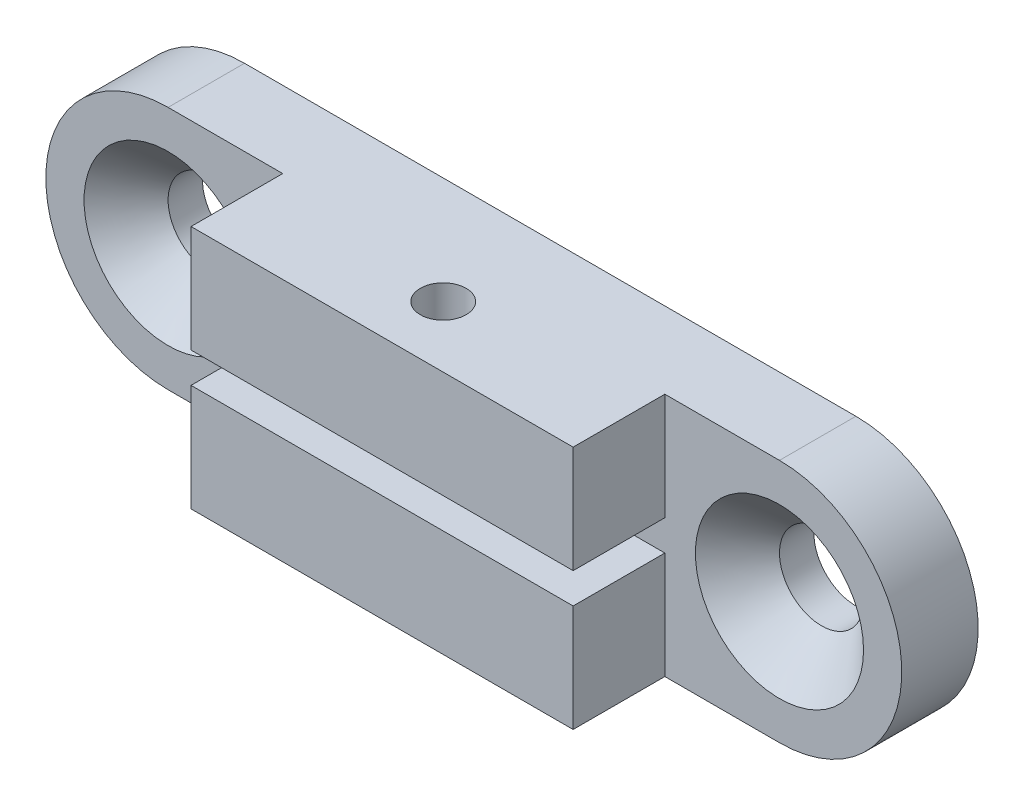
ISO-10303-21;
HEADER;
FILE_DESCRIPTION(('STEP AP214'),'2;1');
FILE_NAME('part.step','',(''),(''),'','','');
FILE_SCHEMA(('AUTOMOTIVE_DESIGN { 1 0 10303 214 1 1 1 1 }'));
ENDSEC;
DATA;
#1=APPLICATION_CONTEXT('core data for automotive mechanical design processes');
#2=APPLICATION_PROTOCOL_DEFINITION('international standard','automotive_design',2000,#1);
#3=PRODUCT_CONTEXT('',#1,'mechanical');
#4=PRODUCT('Part','Part','',(#3));
#5=PRODUCT_RELATED_PRODUCT_CATEGORY('part','',(#4));
#6=PRODUCT_DEFINITION_FORMATION('','',#4);
#7=PRODUCT_DEFINITION_CONTEXT('part definition',#1,'design');
#8=PRODUCT_DEFINITION('design','',#6,#7);
#9=PRODUCT_DEFINITION_SHAPE('','',#8);
#10=(LENGTH_UNIT() NAMED_UNIT(*) SI_UNIT(.MILLI.,.METRE.));
#11=(NAMED_UNIT(*) PLANE_ANGLE_UNIT() SI_UNIT($,.RADIAN.));
#12=(NAMED_UNIT(*) SI_UNIT($,.STERADIAN.) SOLID_ANGLE_UNIT());
#13=UNCERTAINTY_MEASURE_WITH_UNIT(LENGTH_MEASURE(1.E-05),#10,'distance_accuracy_value','');
#14=(GEOMETRIC_REPRESENTATION_CONTEXT(3) GLOBAL_UNCERTAINTY_ASSIGNED_CONTEXT((#13)) GLOBAL_UNIT_ASSIGNED_CONTEXT((#10,
#11,#12)) REPRESENTATION_CONTEXT('',''));
#15=CARTESIAN_POINT('',(0.,0.,0.));
#16=DIRECTION('',(0.,0.,1.));
#17=DIRECTION('',(1.,0.,0.));
#18=AXIS2_PLACEMENT_3D('',#15,#16,#17);
#19=CARTESIAN_POINT('',(12.5,1.,5.));
#20=DIRECTION('',(0.,-1.,0.));
#21=DIRECTION('',(0.,0.,-1.));
#22=AXIS2_PLACEMENT_3D('',#19,#20,#21);
#23=PLANE('',#22);
#24=CARTESIAN_POINT('',(0.,1.,7.));
#25=DIRECTION('',(0.,1.,0.));
#26=DIRECTION('',(0.,0.,1.));
#27=AXIS2_PLACEMENT_3D('',#24,#25,#26);
#28=CIRCLE('',#27,1.5);
#29=CARTESIAN_POINT('',(0.,1.,8.5));
#30=VERTEX_POINT('',#29);
#31=EDGE_CURVE('E162',#30,#30,#28,.T.);
#32=ORIENTED_EDGE('',*,*,#31,.T.);
#33=EDGE_LOOP('',(#32));
#34=FACE_BOUND('',#33,.T.);
#35=DIRECTION('',(1.,0.,0.));
#36=VECTOR('',#35,1.);
#37=CARTESIAN_POINT('',(0.,1.,5.));
#38=LINE('',#37,#36);
#39=CARTESIAN_POINT('',(12.5,1.,5.));
#40=VERTEX_POINT('',#39);
#41=CARTESIAN_POINT('',(-12.5,1.,5.));
#42=VERTEX_POINT('',#41);
#43=EDGE_CURVE('E169',#40,#42,#38,.F.);
#44=ORIENTED_EDGE('',*,*,#43,.F.);
#45=DIRECTION('',(0.,0.,-1.));
#46=VECTOR('',#45,1.);
#47=CARTESIAN_POINT('',(12.5,1.,5.));
#48=LINE('',#47,#46);
#49=CARTESIAN_POINT('',(12.5,1.,11.));
#50=VERTEX_POINT('',#49);
#51=EDGE_CURVE('E165',#50,#40,#48,.T.);
#52=ORIENTED_EDGE('',*,*,#51,.F.);
#53=DIRECTION('',(1.,0.,0.));
#54=VECTOR('',#53,1.);
#55=CARTESIAN_POINT('',(0.,1.,11.));
#56=LINE('',#55,#54);
#57=CARTESIAN_POINT('',(-12.5,1.,11.));
#58=VERTEX_POINT('',#57);
#59=EDGE_CURVE('E130',#58,#50,#56,.T.);
#60=ORIENTED_EDGE('',*,*,#59,.F.);
#61=DIRECTION('',(0.,0.,1.));
#62=VECTOR('',#61,1.);
#63=CARTESIAN_POINT('',(-12.5,1.,5.));
#64=LINE('',#63,#62);
#65=EDGE_CURVE('E179',#42,#58,#64,.T.);
#66=ORIENTED_EDGE('',*,*,#65,.F.);
#67=EDGE_LOOP('',(#44,#52,#60,#66));
#68=FACE_BOUND('',#67,.T.);
#69=ADVANCED_FACE('F15',(#34,#68),#23,.T.);
#70=CARTESIAN_POINT('',(-12.5,-1.,5.));
#71=DIRECTION('',(0.,1.,0.));
#72=DIRECTION('',(0.,0.,1.));
#73=AXIS2_PLACEMENT_3D('',#70,#71,#72);
#74=PLANE('',#73);
#75=CARTESIAN_POINT('',(0.,-1.,7.));
#76=DIRECTION('',(0.,1.,0.));
#77=DIRECTION('',(0.,0.,1.));
#78=AXIS2_PLACEMENT_3D('',#75,#76,#77);
#79=CIRCLE('',#78,1.5);
#80=CARTESIAN_POINT('',(0.,-1.,8.5));
#81=VERTEX_POINT('',#80);
#82=EDGE_CURVE('E18',#81,#81,#79,.F.);
#83=ORIENTED_EDGE('',*,*,#82,.T.);
#84=EDGE_LOOP('',(#83));
#85=FACE_BOUND('',#84,.T.);
#86=DIRECTION('',(1.,0.,0.));
#87=VECTOR('',#86,1.);
#88=CARTESIAN_POINT('',(0.,-1.,5.));
#89=LINE('',#88,#87);
#90=CARTESIAN_POINT('',(-12.5,-1.,5.));
#91=VERTEX_POINT('',#90);
#92=CARTESIAN_POINT('',(12.5,-1.,5.));
#93=VERTEX_POINT('',#92);
#94=EDGE_CURVE('E183',#91,#93,#89,.T.);
#95=ORIENTED_EDGE('',*,*,#94,.F.);
#96=DIRECTION('',(0.,0.,1.));
#97=VECTOR('',#96,1.);
#98=CARTESIAN_POINT('',(-12.5,-1.,5.));
#99=LINE('',#98,#97);
#100=CARTESIAN_POINT('',(-12.5,-1.,11.));
#101=VERTEX_POINT('',#100);
#102=EDGE_CURVE('E125',#101,#91,#99,.F.);
#103=ORIENTED_EDGE('',*,*,#102,.F.);
#104=DIRECTION('',(1.,0.,0.));
#105=VECTOR('',#104,1.);
#106=CARTESIAN_POINT('',(0.,-1.,11.));
#107=LINE('',#106,#105);
#108=CARTESIAN_POINT('',(12.5,-1.,11.));
#109=VERTEX_POINT('',#108);
#110=EDGE_CURVE('E119',#109,#101,#107,.F.);
#111=ORIENTED_EDGE('',*,*,#110,.F.);
#112=DIRECTION('',(0.,0.,-1.));
#113=VECTOR('',#112,1.);
#114=CARTESIAN_POINT('',(12.5,-1.,5.));
#115=LINE('',#114,#113);
#116=EDGE_CURVE('E104',#93,#109,#115,.F.);
#117=ORIENTED_EDGE('',*,*,#116,.F.);
#118=EDGE_LOOP('',(#95,#103,#111,#117));
#119=FACE_BOUND('',#118,.T.);
#120=ADVANCED_FACE('F124',(#85,#119),#74,.T.);
#121=CARTESIAN_POINT('',(12.5,-1.,5.));
#122=DIRECTION('',(1.,0.,0.));
#123=DIRECTION('',(0.,0.,-1.));
#124=AXIS2_PLACEMENT_3D('',#121,#122,#123);
#125=PLANE('',#124);
#126=DIRECTION('',(0.,1.,0.));
#127=VECTOR('',#126,1.);
#128=CARTESIAN_POINT('',(12.5,0.,5.));
#129=LINE('',#128,#127);
#130=CARTESIAN_POINT('',(12.5,-8.,5.));
#131=VERTEX_POINT('',#130);
#132=EDGE_CURVE('E111',#93,#131,#129,.F.);
#133=ORIENTED_EDGE('',*,*,#132,.F.);
#134=ORIENTED_EDGE('',*,*,#116,.T.);
#135=DIRECTION('',(0.,1.,0.));
#136=VECTOR('',#135,1.);
#137=CARTESIAN_POINT('',(12.5,-4.5,11.));
#138=LINE('',#137,#136);
#139=CARTESIAN_POINT('',(12.5,-8.,11.));
#140=VERTEX_POINT('',#139);
#141=EDGE_CURVE('E108',#140,#109,#138,.T.);
#142=ORIENTED_EDGE('',*,*,#141,.F.);
#143=DIRECTION('',(0.,0.,-1.));
#144=VECTOR('',#143,1.);
#145=CARTESIAN_POINT('',(12.5,-8.,0.));
#146=LINE('',#145,#144);
#147=EDGE_CURVE('E188',#131,#140,#146,.F.);
#148=ORIENTED_EDGE('',*,*,#147,.F.);
#149=EDGE_LOOP('',(#133,#134,#142,#148));
#150=FACE_BOUND('',#149,.T.);
#151=ADVANCED_FACE('F106',(#150),#125,.T.);
#152=CARTESIAN_POINT('',(0.,-4.5,11.));
#153=DIRECTION('',(0.,0.,1.));
#154=DIRECTION('',(1.,0.,0.));
#155=AXIS2_PLACEMENT_3D('',#152,#153,#154);
#156=PLANE('',#155);
#157=ORIENTED_EDGE('',*,*,#141,.T.);
#158=ORIENTED_EDGE('',*,*,#110,.T.);
#159=DIRECTION('',(0.,1.,0.));
#160=VECTOR('',#159,1.);
#161=CARTESIAN_POINT('',(-12.5,-8.,11.));
#162=LINE('',#161,#160);
#163=CARTESIAN_POINT('',(-12.5,-8.,11.));
#164=VERTEX_POINT('',#163);
#165=EDGE_CURVE('E126',#164,#101,#162,.T.);
#166=ORIENTED_EDGE('',*,*,#165,.F.);
#167=DIRECTION('',(1.,0.,0.));
#168=VECTOR('',#167,1.);
#169=CARTESIAN_POINT('',(20.,-8.,11.));
#170=LINE('',#169,#168);
#171=EDGE_CURVE('E121',#140,#164,#170,.F.);
#172=ORIENTED_EDGE('',*,*,#171,.F.);
#173=EDGE_LOOP('',(#157,#158,#166,#172));
#174=FACE_BOUND('',#173,.T.);
#175=ADVANCED_FACE('F117',(#174),#156,.T.);
#176=CARTESIAN_POINT('',(-12.5,-8.,5.));
#177=DIRECTION('',(-1.,0.,0.));
#178=DIRECTION('',(0.,0.,1.));
#179=AXIS2_PLACEMENT_3D('',#176,#177,#178);
#180=PLANE('',#179);
#181=DIRECTION('',(0.,1.,0.));
#182=VECTOR('',#181,1.);
#183=CARTESIAN_POINT('',(-12.5,0.,5.));
#184=LINE('',#183,#182);
#185=CARTESIAN_POINT('',(-12.5,-8.,5.));
#186=VERTEX_POINT('',#185);
#187=EDGE_CURVE('E185',#186,#91,#184,.T.);
#188=ORIENTED_EDGE('',*,*,#187,.F.);
#189=DIRECTION('',(0.,0.,-1.));
#190=VECTOR('',#189,1.);
#191=CARTESIAN_POINT('',(-12.5,-8.,0.));
#192=LINE('',#191,#190);
#193=EDGE_CURVE('E190',#164,#186,#192,.T.);
#194=ORIENTED_EDGE('',*,*,#193,.F.);
#195=ORIENTED_EDGE('',*,*,#165,.T.);
#196=ORIENTED_EDGE('',*,*,#102,.T.);
#197=EDGE_LOOP('',(#188,#194,#195,#196));
#198=FACE_BOUND('',#197,.T.);
#199=ADVANCED_FACE('F252',(#198),#180,.T.);
#200=CARTESIAN_POINT('',(0.,-8.,7.));
#201=DIRECTION('',(0.,1.,0.));
#202=DIRECTION('',(0.,0.,1.));
#203=AXIS2_PLACEMENT_3D('',#200,#201,#202);
#204=CYLINDRICAL_SURFACE('',#203,1.5);
#205=ORIENTED_EDGE('',*,*,#82,.F.);
#206=EDGE_LOOP('',(#205));
#207=FACE_BOUND('',#206,.T.);
#208=CARTESIAN_POINT('',(0.,-8.,7.));
#209=DIRECTION('',(0.,1.,0.));
#210=DIRECTION('',(0.,0.,1.));
#211=AXIS2_PLACEMENT_3D('',#208,#209,#210);
#212=CIRCLE('',#211,1.5);
#213=CARTESIAN_POINT('',(0.,-8.,8.5));
#214=VERTEX_POINT('',#213);
#215=EDGE_CURVE('E152',#214,#214,#212,.T.);
#216=ORIENTED_EDGE('',*,*,#215,.F.);
#217=EDGE_LOOP('',(#216));
#218=FACE_BOUND('',#217,.T.);
#219=ADVANCED_FACE('F254',(#207,#218),#204,.F.);
#220=CARTESIAN_POINT('',(-12.5,1.,5.));
#221=DIRECTION('',(-1.,0.,0.));
#222=DIRECTION('',(0.,0.,1.));
#223=AXIS2_PLACEMENT_3D('',#220,#221,#222);
#224=PLANE('',#223);
#225=DIRECTION('',(0.,1.,0.));
#226=VECTOR('',#225,1.);
#227=CARTESIAN_POINT('',(-12.5,0.,5.));
#228=LINE('',#227,#226);
#229=CARTESIAN_POINT('',(-12.5,8.,5.));
#230=VERTEX_POINT('',#229);
#231=EDGE_CURVE('E178',#42,#230,#228,.T.);
#232=ORIENTED_EDGE('',*,*,#231,.F.);
#233=ORIENTED_EDGE('',*,*,#65,.T.);
#234=DIRECTION('',(0.,1.,0.));
#235=VECTOR('',#234,1.);
#236=CARTESIAN_POINT('',(-12.5,4.5,11.));
#237=LINE('',#236,#235);
#238=CARTESIAN_POINT('',(-12.5,8.,11.));
#239=VERTEX_POINT('',#238);
#240=EDGE_CURVE('E181',#239,#58,#237,.F.);
#241=ORIENTED_EDGE('',*,*,#240,.F.);
#242=DIRECTION('',(0.,0.,1.));
#243=VECTOR('',#242,1.);
#244=CARTESIAN_POINT('',(-12.5,8.,0.));
#245=LINE('',#244,#243);
#246=EDGE_CURVE('E200',#230,#239,#245,.T.);
#247=ORIENTED_EDGE('',*,*,#246,.F.);
#248=EDGE_LOOP('',(#232,#233,#241,#247));
#249=FACE_BOUND('',#248,.T.);
#250=ADVANCED_FACE('F261',(#249),#224,.T.);
#251=CARTESIAN_POINT('',(0.,4.5,11.));
#252=DIRECTION('',(0.,0.,1.));
#253=DIRECTION('',(1.,0.,0.));
#254=AXIS2_PLACEMENT_3D('',#251,#252,#253);
#255=PLANE('',#254);
#256=ORIENTED_EDGE('',*,*,#59,.T.);
#257=DIRECTION('',(0.,1.,0.));
#258=VECTOR('',#257,1.);
#259=CARTESIAN_POINT('',(12.5,8.,11.));
#260=LINE('',#259,#258);
#261=CARTESIAN_POINT('',(12.5,8.,11.));
#262=VERTEX_POINT('',#261);
#263=EDGE_CURVE('E171',#262,#50,#260,.F.);
#264=ORIENTED_EDGE('',*,*,#263,.F.);
#265=DIRECTION('',(1.,0.,0.));
#266=VECTOR('',#265,1.);
#267=CARTESIAN_POINT('',(-20.,8.,11.));
#268=LINE('',#267,#266);
#269=EDGE_CURVE('E202',#239,#262,#268,.T.);
#270=ORIENTED_EDGE('',*,*,#269,.F.);
#271=ORIENTED_EDGE('',*,*,#240,.T.);
#272=EDGE_LOOP('',(#256,#264,#270,#271));
#273=FACE_BOUND('',#272,.T.);
#274=ADVANCED_FACE('F310',(#273),#255,.T.);
#275=CARTESIAN_POINT('',(12.5,8.,5.));
#276=DIRECTION('',(1.,0.,0.));
#277=DIRECTION('',(0.,0.,-1.));
#278=AXIS2_PLACEMENT_3D('',#275,#276,#277);
#279=PLANE('',#278);
#280=DIRECTION('',(0.,1.,0.));
#281=VECTOR('',#280,1.);
#282=CARTESIAN_POINT('',(12.5,0.,5.));
#283=LINE('',#282,#281);
#284=CARTESIAN_POINT('',(12.5,8.,5.));
#285=VERTEX_POINT('',#284);
#286=EDGE_CURVE('E164',#285,#40,#283,.F.);
#287=ORIENTED_EDGE('',*,*,#286,.F.);
#288=DIRECTION('',(0.,0.,1.));
#289=VECTOR('',#288,1.);
#290=CARTESIAN_POINT('',(12.5,8.,0.));
#291=LINE('',#290,#289);
#292=EDGE_CURVE('E63',#262,#285,#291,.F.);
#293=ORIENTED_EDGE('',*,*,#292,.F.);
#294=ORIENTED_EDGE('',*,*,#263,.T.);
#295=ORIENTED_EDGE('',*,*,#51,.T.);
#296=EDGE_LOOP('',(#287,#293,#294,#295));
#297=FACE_BOUND('',#296,.T.);
#298=ADVANCED_FACE('F306',(#297),#279,.T.);
#299=CARTESIAN_POINT('',(0.,-8.,7.));
#300=DIRECTION('',(0.,1.,0.));
#301=DIRECTION('',(0.,0.,1.));
#302=AXIS2_PLACEMENT_3D('',#299,#300,#301);
#303=CYLINDRICAL_SURFACE('',#302,1.5);
#304=CARTESIAN_POINT('',(0.,8.,7.));
#305=DIRECTION('',(0.,1.,0.));
#306=DIRECTION('',(0.,0.,1.));
#307=AXIS2_PLACEMENT_3D('',#304,#305,#306);
#308=CIRCLE('',#307,1.5);
#309=CARTESIAN_POINT('',(0.,8.,8.5));
#310=VERTEX_POINT('',#309);
#311=EDGE_CURVE('E144',#310,#310,#308,.F.);
#312=ORIENTED_EDGE('',*,*,#311,.F.);
#313=EDGE_LOOP('',(#312));
#314=FACE_BOUND('',#313,.T.);
#315=ORIENTED_EDGE('',*,*,#31,.F.);
#316=EDGE_LOOP('',(#315));
#317=FACE_BOUND('',#316,.T.);
#318=ADVANCED_FACE('F302',(#314,#317),#303,.F.);
#319=CARTESIAN_POINT('',(0.,0.,5.));
#320=DIRECTION('',(0.,0.,1.));
#321=DIRECTION('',(1.,0.,0.));
#322=AXIS2_PLACEMENT_3D('',#319,#320,#321);
#323=PLANE('',#322);
#324=CARTESIAN_POINT('',(-20.,0.,5.00000000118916));
#325=DIRECTION('',(0.,0.,1.));
#326=DIRECTION('',(1.,0.,0.));
#327=AXIS2_PLACEMENT_3D('',#324,#325,#326);
#328=CIRCLE('',#327,5.49999999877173);
#329=CARTESIAN_POINT('',(-14.5000000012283,0.,5.00000000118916));
#330=VERTEX_POINT('',#329);
#331=EDGE_CURVE('E156',#330,#330,#328,.F.);
#332=ORIENTED_EDGE('',*,*,#331,.T.);
#333=EDGE_LOOP('',(#332));
#334=FACE_BOUND('',#333,.T.);
#335=CARTESIAN_POINT('',(20.,0.,5.00000000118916));
#336=DIRECTION('',(0.,0.,1.));
#337=DIRECTION('',(1.,0.,0.));
#338=AXIS2_PLACEMENT_3D('',#335,#336,#337);
#339=CIRCLE('',#338,5.49999999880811);
#340=CARTESIAN_POINT('',(25.4999999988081,0.,5.00000000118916));
#341=VERTEX_POINT('',#340);
#342=EDGE_CURVE('E160',#341,#341,#339,.F.);
#343=ORIENTED_EDGE('',*,*,#342,.T.);
#344=EDGE_LOOP('',(#343));
#345=FACE_BOUND('',#344,.T.);
#346=CARTESIAN_POINT('',(20.,0.,5.));
#347=DIRECTION('',(0.,0.,1.));
#348=DIRECTION('',(1.,0.,0.));
#349=AXIS2_PLACEMENT_3D('',#346,#347,#348);
#350=CIRCLE('',#349,8.);
#351=CARTESIAN_POINT('',(20.,8.,5.));
#352=VERTEX_POINT('',#351);
#353=CARTESIAN_POINT('',(20.,-8.,5.));
#354=VERTEX_POINT('',#353);
#355=EDGE_CURVE('E148',#352,#354,#350,.F.);
#356=ORIENTED_EDGE('',*,*,#355,.F.);
#357=DIRECTION('',(1.,0.,0.));
#358=VECTOR('',#357,1.);
#359=CARTESIAN_POINT('',(-20.,8.,5.));
#360=LINE('',#359,#358);
#361=EDGE_CURVE('E57',#285,#352,#360,.T.);
#362=ORIENTED_EDGE('',*,*,#361,.F.);
#363=ORIENTED_EDGE('',*,*,#286,.T.);
#364=ORIENTED_EDGE('',*,*,#43,.T.);
#365=ORIENTED_EDGE('',*,*,#231,.T.);
#366=DIRECTION('',(1.,0.,0.));
#367=VECTOR('',#366,1.);
#368=CARTESIAN_POINT('',(-20.,8.,5.));
#369=LINE('',#368,#367);
#370=CARTESIAN_POINT('',(-20.,8.,5.));
#371=VERTEX_POINT('',#370);
#372=EDGE_CURVE('E203',#371,#230,#369,.T.);
#373=ORIENTED_EDGE('',*,*,#372,.F.);
#374=CARTESIAN_POINT('',(-20.,0.,5.));
#375=DIRECTION('',(0.,0.,1.));
#376=DIRECTION('',(1.,0.,0.));
#377=AXIS2_PLACEMENT_3D('',#374,#375,#376);
#378=CIRCLE('',#377,8.);
#379=CARTESIAN_POINT('',(-20.,-8.,5.));
#380=VERTEX_POINT('',#379);
#381=EDGE_CURVE('E142',#380,#371,#378,.F.);
#382=ORIENTED_EDGE('',*,*,#381,.F.);
#383=DIRECTION('',(1.,0.,0.));
#384=VECTOR('',#383,1.);
#385=CARTESIAN_POINT('',(20.,-8.,5.));
#386=LINE('',#385,#384);
#387=EDGE_CURVE('E155',#186,#380,#386,.F.);
#388=ORIENTED_EDGE('',*,*,#387,.F.);
#389=ORIENTED_EDGE('',*,*,#187,.T.);
#390=ORIENTED_EDGE('',*,*,#94,.T.);
#391=ORIENTED_EDGE('',*,*,#132,.T.);
#392=DIRECTION('',(1.,0.,0.));
#393=VECTOR('',#392,1.);
#394=CARTESIAN_POINT('',(20.,-8.,5.));
#395=LINE('',#394,#393);
#396=EDGE_CURVE('E159',#354,#131,#395,.F.);
#397=ORIENTED_EDGE('',*,*,#396,.F.);
#398=EDGE_LOOP('',(#356,#362,#363,#364,#365,#373,#382,#388,#389,#390,#391,#397));
#399=FACE_BOUND('',#398,.T.);
#400=ADVANCED_FACE('F248',(#334,#345,#399),#323,.T.);
#401=CARTESIAN_POINT('',(20.,0.,5.00000000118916));
#402=DIRECTION('',(0.,0.,1.));
#403=DIRECTION('',(1.,0.,0.));
#404=AXIS2_PLACEMENT_3D('',#401,#402,#403);
#405=CONICAL_SURFACE('',#404,5.49999999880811,0.785398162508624);
#406=ORIENTED_EDGE('',*,*,#342,.F.);
#407=EDGE_LOOP('',(#406));
#408=FACE_BOUND('',#407,.T.);
#409=CARTESIAN_POINT('',(20.,0.,2.25));
#410=DIRECTION('',(0.,0.,1.));
#411=DIRECTION('',(1.,0.,0.));
#412=AXIS2_PLACEMENT_3D('',#409,#410,#411);
#413=CIRCLE('',#412,2.75);
#414=CARTESIAN_POINT('',(22.75,0.,2.25));
#415=VERTEX_POINT('',#414);
#416=EDGE_CURVE('E217',#415,#415,#413,.F.);
#417=ORIENTED_EDGE('',*,*,#416,.T.);
#418=EDGE_LOOP('',(#417));
#419=FACE_BOUND('',#418,.T.);
#420=ADVANCED_FACE('F295',(#408,#419),#405,.F.);
#421=CARTESIAN_POINT('',(-20.,0.,5.00000000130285));
#422=DIRECTION('',(0.,0.,1.));
#423=DIRECTION('',(1.,0.,0.));
#424=AXIS2_PLACEMENT_3D('',#421,#422,#423);
#425=CONICAL_SURFACE('',#424,5.49999999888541,0.785398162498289);
#426=ORIENTED_EDGE('',*,*,#331,.F.);
#427=EDGE_LOOP('',(#426));
#428=FACE_BOUND('',#427,.T.);
#429=CARTESIAN_POINT('',(-20.,0.,2.25));
#430=DIRECTION('',(0.,0.,1.));
#431=DIRECTION('',(1.,0.,0.));
#432=AXIS2_PLACEMENT_3D('',#429,#430,#431);
#433=CIRCLE('',#432,2.75);
#434=CARTESIAN_POINT('',(-17.25,0.,2.25));
#435=VERTEX_POINT('',#434);
#436=EDGE_CURVE('E223',#435,#435,#433,.F.);
#437=ORIENTED_EDGE('',*,*,#436,.T.);
#438=EDGE_LOOP('',(#437));
#439=FACE_BOUND('',#438,.T.);
#440=ADVANCED_FACE('F291',(#428,#439),#425,.F.);
#441=CARTESIAN_POINT('',(20.,-8.,0.));
#442=DIRECTION('',(0.,-1.,0.));
#443=DIRECTION('',(0.,0.,-1.));
#444=AXIS2_PLACEMENT_3D('',#441,#442,#443);
#445=PLANE('',#444);
#446=ORIENTED_EDGE('',*,*,#215,.T.);
#447=EDGE_LOOP('',(#446));
#448=FACE_BOUND('',#447,.T.);
#449=DIRECTION('',(1.,0.,0.));
#450=VECTOR('',#449,1.);
#451=CARTESIAN_POINT('',(0.,-8.,0.));
#452=LINE('',#451,#450);
#453=CARTESIAN_POINT('',(-20.,-8.,0.));
#454=VERTEX_POINT('',#453);
#455=CARTESIAN_POINT('',(20.,-8.,0.));
#456=VERTEX_POINT('',#455);
#457=EDGE_CURVE('E141',#454,#456,#452,.T.);
#458=ORIENTED_EDGE('',*,*,#457,.T.);
#459=DIRECTION('',(0.,0.,1.));
#460=VECTOR('',#459,1.);
#461=CARTESIAN_POINT('',(20.,-8.,0.));
#462=LINE('',#461,#460);
#463=EDGE_CURVE('E151',#354,#456,#462,.F.);
#464=ORIENTED_EDGE('',*,*,#463,.F.);
#465=ORIENTED_EDGE('',*,*,#396,.T.);
#466=ORIENTED_EDGE('',*,*,#147,.T.);
#467=ORIENTED_EDGE('',*,*,#171,.T.);
#468=ORIENTED_EDGE('',*,*,#193,.T.);
#469=ORIENTED_EDGE('',*,*,#387,.T.);
#470=DIRECTION('',(0.,0.,1.));
#471=VECTOR('',#470,1.);
#472=CARTESIAN_POINT('',(-20.,-8.,0.));
#473=LINE('',#472,#471);
#474=EDGE_CURVE('E214',#454,#380,#473,.T.);
#475=ORIENTED_EDGE('',*,*,#474,.F.);
#476=EDGE_LOOP('',(#458,#464,#465,#466,#467,#468,#469,#475));
#477=FACE_BOUND('',#476,.T.);
#478=ADVANCED_FACE('F242',(#448,#477),#445,.T.);
#479=CARTESIAN_POINT('',(20.,0.,0.));
#480=DIRECTION('',(0.,0.,1.));
#481=DIRECTION('',(1.,0.,0.));
#482=AXIS2_PLACEMENT_3D('',#479,#480,#481);
#483=CYLINDRICAL_SURFACE('',#482,8.);
#484=CARTESIAN_POINT('',(20.,0.,0.));
#485=DIRECTION('',(0.,0.,1.));
#486=DIRECTION('',(1.,0.,0.));
#487=AXIS2_PLACEMENT_3D('',#484,#485,#486);
#488=CIRCLE('',#487,8.);
#489=CARTESIAN_POINT('',(20.,8.,0.));
#490=VERTEX_POINT('',#489);
#491=EDGE_CURVE('E138',#456,#490,#488,.T.);
#492=ORIENTED_EDGE('',*,*,#491,.T.);
#493=DIRECTION('',(0.,0.,1.));
#494=VECTOR('',#493,1.);
#495=CARTESIAN_POINT('',(20.,8.,0.));
#496=LINE('',#495,#494);
#497=EDGE_CURVE('E147',#352,#490,#496,.F.);
#498=ORIENTED_EDGE('',*,*,#497,.F.);
#499=ORIENTED_EDGE('',*,*,#355,.T.);
#500=ORIENTED_EDGE('',*,*,#463,.T.);
#501=EDGE_LOOP('',(#492,#498,#499,#500));
#502=FACE_BOUND('',#501,.T.);
#503=ADVANCED_FACE('F238',(#502),#483,.T.);
#504=CARTESIAN_POINT('',(-20.,8.,0.));
#505=DIRECTION('',(0.,1.,0.));
#506=DIRECTION('',(0.,0.,1.));
#507=AXIS2_PLACEMENT_3D('',#504,#505,#506);
#508=PLANE('',#507);
#509=ORIENTED_EDGE('',*,*,#311,.T.);
#510=EDGE_LOOP('',(#509));
#511=FACE_BOUND('',#510,.T.);
#512=DIRECTION('',(1.,0.,0.));
#513=VECTOR('',#512,1.);
#514=CARTESIAN_POINT('',(0.,8.,0.));
#515=LINE('',#514,#513);
#516=CARTESIAN_POINT('',(-20.,8.,0.));
#517=VERTEX_POINT('',#516);
#518=EDGE_CURVE('E137',#490,#517,#515,.F.);
#519=ORIENTED_EDGE('',*,*,#518,.T.);
#520=DIRECTION('',(0.,0.,1.));
#521=VECTOR('',#520,1.);
#522=CARTESIAN_POINT('',(-20.,8.,0.));
#523=LINE('',#522,#521);
#524=EDGE_CURVE('E33',#371,#517,#523,.F.);
#525=ORIENTED_EDGE('',*,*,#524,.F.);
#526=ORIENTED_EDGE('',*,*,#372,.T.);
#527=ORIENTED_EDGE('',*,*,#246,.T.);
#528=ORIENTED_EDGE('',*,*,#269,.T.);
#529=ORIENTED_EDGE('',*,*,#292,.T.);
#530=ORIENTED_EDGE('',*,*,#361,.T.);
#531=ORIENTED_EDGE('',*,*,#497,.T.);
#532=EDGE_LOOP('',(#519,#525,#526,#527,#528,#529,#530,#531));
#533=FACE_BOUND('',#532,.T.);
#534=ADVANCED_FACE('F232',(#511,#533),#508,.T.);
#535=CARTESIAN_POINT('',(-20.,0.,0.));
#536=DIRECTION('',(0.,0.,1.));
#537=DIRECTION('',(1.,0.,0.));
#538=AXIS2_PLACEMENT_3D('',#535,#536,#537);
#539=CYLINDRICAL_SURFACE('',#538,8.);
#540=CARTESIAN_POINT('',(-20.,0.,0.));
#541=DIRECTION('',(0.,0.,1.));
#542=DIRECTION('',(1.,0.,0.));
#543=AXIS2_PLACEMENT_3D('',#540,#541,#542);
#544=CIRCLE('',#543,8.);
#545=EDGE_CURVE('E135',#517,#454,#544,.T.);
#546=ORIENTED_EDGE('',*,*,#545,.T.);
#547=ORIENTED_EDGE('',*,*,#474,.T.);
#548=ORIENTED_EDGE('',*,*,#381,.T.);
#549=ORIENTED_EDGE('',*,*,#524,.T.);
#550=EDGE_LOOP('',(#546,#547,#548,#549));
#551=FACE_BOUND('',#550,.T.);
#552=ADVANCED_FACE('F280',(#551),#539,.T.);
#553=CARTESIAN_POINT('',(20.,0.,0.));
#554=DIRECTION('',(0.,0.,1.));
#555=DIRECTION('',(1.,0.,0.));
#556=AXIS2_PLACEMENT_3D('',#553,#554,#555);
#557=CYLINDRICAL_SURFACE('',#556,2.75);
#558=ORIENTED_EDGE('',*,*,#416,.F.);
#559=EDGE_LOOP('',(#558));
#560=FACE_BOUND('',#559,.T.);
#561=CARTESIAN_POINT('',(20.,0.,0.));
#562=DIRECTION('',(0.,0.,1.));
#563=DIRECTION('',(1.,0.,0.));
#564=AXIS2_PLACEMENT_3D('',#561,#562,#563);
#565=CIRCLE('',#564,2.75);
#566=CARTESIAN_POINT('',(22.75,0.,0.));
#567=VERTEX_POINT('',#566);
#568=EDGE_CURVE('E24',#567,#567,#565,.F.);
#569=ORIENTED_EDGE('',*,*,#568,.T.);
#570=EDGE_LOOP('',(#569));
#571=FACE_BOUND('',#570,.T.);
#572=ADVANCED_FACE('F272',(#560,#571),#557,.F.);
#573=CARTESIAN_POINT('',(-20.,0.,0.));
#574=DIRECTION('',(0.,0.,1.));
#575=DIRECTION('',(1.,0.,0.));
#576=AXIS2_PLACEMENT_3D('',#573,#574,#575);
#577=CYLINDRICAL_SURFACE('',#576,2.75);
#578=ORIENTED_EDGE('',*,*,#436,.F.);
#579=EDGE_LOOP('',(#578));
#580=FACE_BOUND('',#579,.T.);
#581=CARTESIAN_POINT('',(-20.,0.,0.));
#582=DIRECTION('',(0.,0.,1.));
#583=DIRECTION('',(1.,0.,0.));
#584=AXIS2_PLACEMENT_3D('',#581,#582,#583);
#585=CIRCLE('',#584,2.75);
#586=CARTESIAN_POINT('',(-17.25,0.,0.));
#587=VERTEX_POINT('',#586);
#588=EDGE_CURVE('E10',#587,#587,#585,.F.);
#589=ORIENTED_EDGE('',*,*,#588,.T.);
#590=EDGE_LOOP('',(#589));
#591=FACE_BOUND('',#590,.T.);
#592=ADVANCED_FACE('F266',(#580,#591),#577,.F.);
#593=CARTESIAN_POINT('',(0.,0.,0.));
#594=DIRECTION('',(0.,0.,1.));
#595=DIRECTION('',(1.,0.,0.));
#596=AXIS2_PLACEMENT_3D('',#593,#594,#595);
#597=PLANE('',#596);
#598=ORIENTED_EDGE('',*,*,#588,.F.);
#599=EDGE_LOOP('',(#598));
#600=FACE_BOUND('',#599,.T.);
#601=ORIENTED_EDGE('',*,*,#568,.F.);
#602=EDGE_LOOP('',(#601));
#603=FACE_BOUND('',#602,.T.);
#604=ORIENTED_EDGE('',*,*,#518,.F.);
#605=ORIENTED_EDGE('',*,*,#491,.F.);
#606=ORIENTED_EDGE('',*,*,#457,.F.);
#607=ORIENTED_EDGE('',*,*,#545,.F.);
#608=EDGE_LOOP('',(#604,#605,#606,#607));
#609=FACE_BOUND('',#608,.T.);
#610=ADVANCED_FACE('F236',(#600,#603,#609),#597,.F.);
#611=CLOSED_SHELL('',(#69,#120,#151,#175,#199,#219,#250,#274,#298,#318,#400,#420,#440,#478,#503,
#534,#552,#572,#592,#610));
#612=MANIFOLD_SOLID_BREP('B1',#611);
#613=ADVANCED_BREP_SHAPE_REPRESENTATION('',(#18,#612),#14);
#614=SHAPE_DEFINITION_REPRESENTATION(#9,#613);
ENDSEC;
END-ISO-10303-21;
